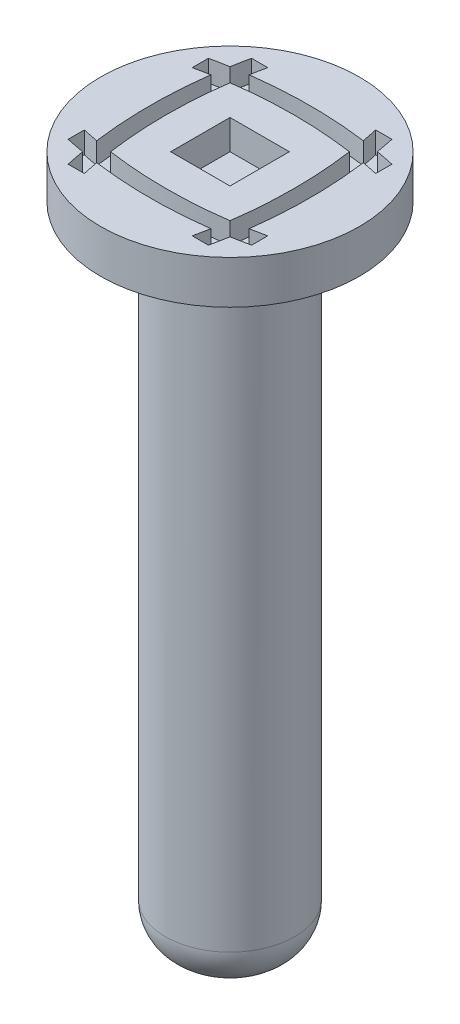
from build123d import *

# Parameters (mm, degrees)
SKETCH1_R           = 24
BOSS_EXTRUDE1_DEPTH = 8
SKETCH3_W           = 11
SKETCH3_H           = 11
CUT_EXTRUDE2_DEPTH  = 5.5
CUT_EXTRUDE6_DEPTH  = 4
SKETCH11_W          = 12
SKETCH11_H          = 120
FILLET1_R           = 8


with BuildPart() as part:
    # Sketch1 → Boss-Extrude1 (new body)
    with BuildSketch(Plane(origin=(0, 0, 0), x_dir=(1, 0, 0), z_dir=(0, 1, 0))):
        with Locations(Location((0, 0, 0), (0, 0, 270))):
            Circle(SKETCH1_R)
    extrude(amount=BOSS_EXTRUDE1_DEPTH)

    # Sketch3 → Cut-Extrude2 (cut)
    with BuildSketch(Plane(origin=(0, 8, 0), x_dir=(1, 0, 0), z_dir=(0, 1, 0))):
        Rectangle(SKETCH3_W, SKETCH3_H)
    extrude(amount=-CUT_EXTRUDE2_DEPTH, mode=Mode.SUBTRACT)

    # Sketch10 → Cut-Extrude6 (cut)
    with BuildSketch(Plane(origin=(0, 8, 0), x_dir=(1, 0, 0), z_dir=(0, 1, 0))):
        with BuildLine():
            Line((-17, 13), (-17, 10))
            ThreePointArc((-17, 10), (-15.565150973, 10.301241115), (-14.124974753, 10.575887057))
            ThreePointArc((-14.124974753, 10.575887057), (-14.827114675, 0), (-14.124974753, -10.575887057))
            ThreePointArc((-14.124974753, -10.575887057), (-15.565150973, -10.301241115), (-17, -10))
            Line((-17, -10), (-17, -13))
            ThreePointArc((-17, -13), (-15.330185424, -13.344535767), (-13.653407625, -13.653407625))
            ThreePointArc((-13.653407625, -13.653407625), (-13.344535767, -15.330185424), (-13, -17))
            Line((-13, -17), (-10, -17))
            ThreePointArc((-10, -17), (-10.301241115, -15.565150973), (-10.575887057, -14.124974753))
            ThreePointArc((-10.575887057, -14.124974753), (0, -14.827114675), (10.575887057, -14.124974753))
            ThreePointArc((10.575887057, -14.124974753), (10.301241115, -15.565150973), (10, -17))
            Line((10, -17), (13, -17))
            ThreePointArc((13, -17), (13.344535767, -15.330185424), (13.653407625, -13.653407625))
            ThreePointArc((13.653407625, -13.653407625), (15.330185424, -13.344535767), (17, -13))
            Line((17, -13), (17, -10))
            ThreePointArc((17, -10), (15.565150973, -10.301241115), (14.124974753, -10.575887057))
            ThreePointArc((14.124974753, -10.575887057), (14.827114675, 0), (14.124974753, 10.575887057))
            ThreePointArc((14.124974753, 10.575887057), (15.565150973, 10.301241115), (17, 10))
            Line((17, 10), (17, 13))
            ThreePointArc((17, 13), (15.330185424, 13.344535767), (13.653407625, 13.653407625))
            ThreePointArc((13.653407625, 13.653407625), (13.344535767, 15.330185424), (13, 17))
            Line((13, 17), (10, 17))
            ThreePointArc((10, 17), (10.301241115, 15.565150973), (10.575887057, 14.124974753))
            ThreePointArc((10.575887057, 14.124974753), (0, 14.827114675), (-10.575887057, 14.124974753))
            ThreePointArc((-10.575887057, 14.124974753), (-10.301241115, 15.565150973), (-10, 17))
            Line((-10, 17), (-13, 17))
            ThreePointArc((-13, 17), (-13.344535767, 15.330185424), (-13.653407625, 13.653407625))
            ThreePointArc((-13.653407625, 13.653407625), (-15.330185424, 13.344535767), (-17, 13))
        make_face()
        with BuildLine():
            ThreePointArc((-11.068117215, 11.068117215), (0, 11.844812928), (11.068117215, 11.068117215))
            ThreePointArc((11.068117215, 11.068117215), (11.844812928, 0), (11.068117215, -11.068117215))
            ThreePointArc((11.068117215, -11.068117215), (0, -11.844812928), (-11.068117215, -11.068117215))
            ThreePointArc((-11.068117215, -11.068117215), (-11.844812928, 0), (-11.068117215, 11.068117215))
        make_face(mode=Mode.SUBTRACT)
    extrude(amount=-CUT_EXTRUDE6_DEPTH, mode=Mode.SUBTRACT)

    # Sketch11 → Revolve1 (revolve)
    with BuildSketch(Plane.XY, mode=Mode.PRIVATE) as revolve1_sk:
        with Locations((6, -60)):
            Rectangle(SKETCH11_W, SKETCH11_H)
    revolve(revolve1_sk.sketch.rotate(Axis((0, 0, 0), (0, -1, 0)), 180), axis=Axis((0, 0, 0), (0, -1, 0)))

    # Fillet1
    fillet1_edges = [part.edges().sort_by_distance(p)[0] for p in [
        (12, -120, 0),
    ]]
    fillet(fillet1_edges, radius=FILLET1_R)


solid = part.part
